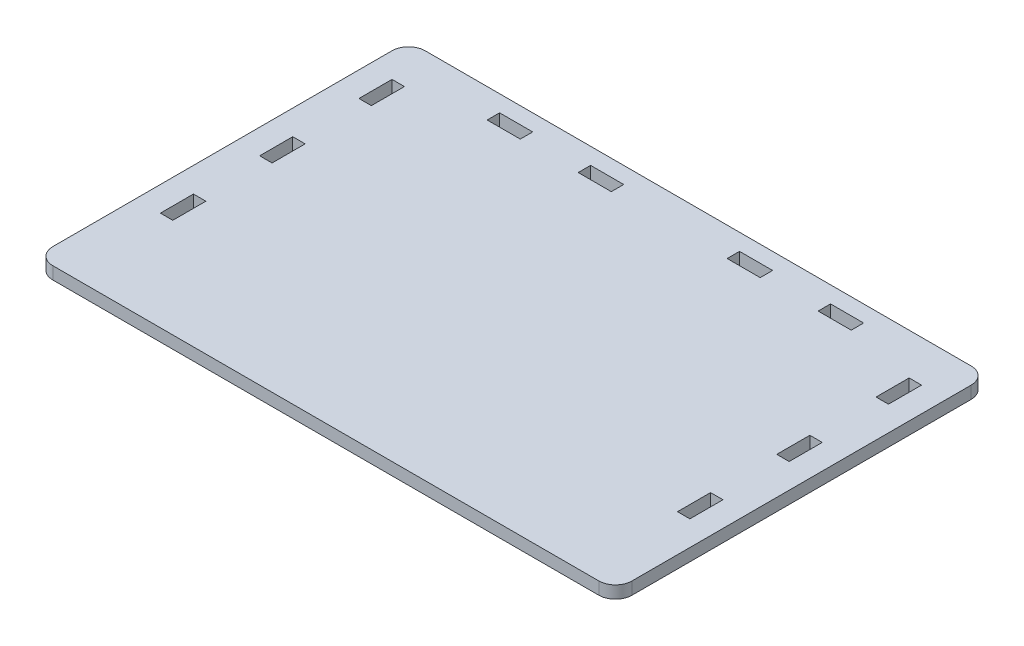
from build123d import *

# Parameters (mm, degrees)
CROQUIS1_W              = 700
CROQUIS1_H              = 450
SALIENTE_EXTRUIR1_DEPTH = 15
REDONDEO1_R             = 20
CROQUIS2_W              = 15
CROQUIS2_H              = 40
CROQUIS2_W_2            = 40
CROQUIS2_H_2            = 15
CORTAR_EXTRUIR1_DEPTH   = 15


with BuildPart() as part:
    # Croquis1 → Saliente-Extruir1 (new body)
    with BuildSketch(Plane(origin=(0, 0, 0), x_dir=(1, 0, 0), z_dir=(0, 1, 0))):
        Rectangle(CROQUIS1_W, CROQUIS1_H)
    extrude(amount=SALIENTE_EXTRUIR1_DEPTH)

    # Redondeo1
    redondeo1_edges = [part.edges().sort_by_distance(p)[0] for p in [
        (350, 7.5, 225),
        (-350, 7.5, 225),
        (-350, 7.5, -225),
        (350, 7.5, -225),
    ]]
    fillet(redondeo1_edges, radius=REDONDEO1_R)

    # Croquis2 → Cortar-Extruir1 (cut)
    with BuildSketch(Plane(origin=(0, 0, 0), x_dir=(1, 0, 0), z_dir=(0, 1, 0))):
        with Locations((312.5, 155)):
            Rectangle(CROQUIS2_W, CROQUIS2_H)
        with Locations((-200, 197.5)):
            Rectangle(CROQUIS2_W_2, CROQUIS2_H_2)
        with Locations((-90, 197.5)):
            Rectangle(CROQUIS2_W_2, CROQUIS2_H_2)
        with Locations((90, 197.5)):
            Rectangle(CROQUIS2_W_2, CROQUIS2_H_2)
        with Locations((200, 197.5)):
            Rectangle(CROQUIS2_W_2, CROQUIS2_H_2)
        with Locations((-312.5, 155)):
            Rectangle(CROQUIS2_W, CROQUIS2_H)
        with Locations((-312.5, 35)):
            Rectangle(CROQUIS2_W, CROQUIS2_H)
        with Locations((-312.5, -85)):
            Rectangle(CROQUIS2_W, CROQUIS2_H)
        with Locations((312.5, -85)):
            Rectangle(CROQUIS2_W, CROQUIS2_H)
        with Locations((312.5, 35)):
            Rectangle(CROQUIS2_W, CROQUIS2_H)
    extrude(amount=CORTAR_EXTRUIR1_DEPTH, mode=Mode.SUBTRACT)


solid = part.part
